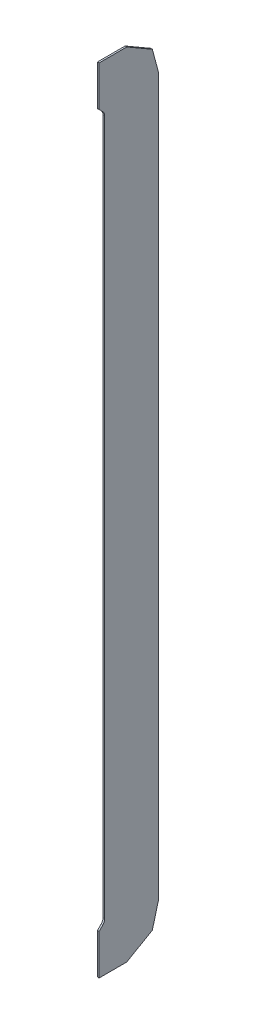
ISO-10303-21;
HEADER;
FILE_DESCRIPTION(('STEP AP214'),'2;1');
FILE_NAME('part.step','',(''),(''),'','','');
FILE_SCHEMA(('AUTOMOTIVE_DESIGN { 1 0 10303 214 1 1 1 1 }'));
ENDSEC;
DATA;
#1=APPLICATION_CONTEXT('core data for automotive mechanical design processes');
#2=APPLICATION_PROTOCOL_DEFINITION('international standard','automotive_design',2000,#1);
#3=PRODUCT_CONTEXT('',#1,'mechanical');
#4=PRODUCT('Part','Part','',(#3));
#5=PRODUCT_RELATED_PRODUCT_CATEGORY('part','',(#4));
#6=PRODUCT_DEFINITION_FORMATION('','',#4);
#7=PRODUCT_DEFINITION_CONTEXT('part definition',#1,'design');
#8=PRODUCT_DEFINITION('design','',#6,#7);
#9=PRODUCT_DEFINITION_SHAPE('','',#8);
#10=(LENGTH_UNIT() NAMED_UNIT(*) SI_UNIT(.MILLI.,.METRE.));
#11=(NAMED_UNIT(*) PLANE_ANGLE_UNIT() SI_UNIT($,.RADIAN.));
#12=(NAMED_UNIT(*) SI_UNIT($,.STERADIAN.) SOLID_ANGLE_UNIT());
#13=UNCERTAINTY_MEASURE_WITH_UNIT(LENGTH_MEASURE(1.E-05),#10,'distance_accuracy_value','');
#14=(GEOMETRIC_REPRESENTATION_CONTEXT(3) GLOBAL_UNCERTAINTY_ASSIGNED_CONTEXT((#13)) GLOBAL_UNIT_ASSIGNED_CONTEXT((#10,
#11,#12)) REPRESENTATION_CONTEXT('',''));
#15=CARTESIAN_POINT('',(0.,0.,0.));
#16=DIRECTION('',(0.,0.,1.));
#17=DIRECTION('',(1.,0.,0.));
#18=AXIS2_PLACEMENT_3D('',#15,#16,#17);
#19=CARTESIAN_POINT('',(19.0500000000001,8973.4125,673.00625));
#20=DIRECTION('',(0.,0.,-1.));
#21=DIRECTION('',(-1.,0.,0.));
#22=AXIS2_PLACEMENT_3D('',#19,#20,#21);
#23=PLANE('',#22);
#24=DIRECTION('',(1.,0.,0.));
#25=VECTOR('',#24,1.);
#26=CARTESIAN_POINT('',(-19.0500000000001,-8059.0125,673.00625));
#27=LINE('',#26,#25);
#28=CARTESIAN_POINT('',(-19.0500000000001,-8059.0125,673.00625));
#29=VERTEX_POINT('',#28);
#30=CARTESIAN_POINT('',(19.0500000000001,-8059.0125,673.00625));
#31=VERTEX_POINT('',#30);
#32=EDGE_CURVE('E155',#29,#31,#27,.T.);
#33=ORIENTED_EDGE('',*,*,#32,.F.);
#34=DIRECTION('',(0.,-1.,0.));
#35=VECTOR('',#34,1.);
#36=CARTESIAN_POINT('',(-19.0499999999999,8973.4125,673.00625));
#37=LINE('',#36,#35);
#38=CARTESIAN_POINT('',(-19.0499999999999,-8973.4125,673.00625));
#39=VERTEX_POINT('',#38);
#40=EDGE_CURVE('E189',#29,#39,#37,.T.);
#41=ORIENTED_EDGE('',*,*,#40,.T.);
#42=DIRECTION('',(1.,0.,0.));
#43=VECTOR('',#42,1.);
#44=CARTESIAN_POINT('',(19.0500000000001,-8973.4125,673.00625));
#45=LINE('',#44,#43);
#46=CARTESIAN_POINT('',(19.0500000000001,-8973.4125,673.00625));
#47=VERTEX_POINT('',#46);
#48=EDGE_CURVE('E177',#39,#47,#45,.T.);
#49=ORIENTED_EDGE('',*,*,#48,.T.);
#50=DIRECTION('',(0.,-1.,0.));
#51=VECTOR('',#50,1.);
#52=CARTESIAN_POINT('',(19.0500000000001,8973.4125,673.00625));
#53=LINE('',#52,#51);
#54=EDGE_CURVE('E171',#31,#47,#53,.T.);
#55=ORIENTED_EDGE('',*,*,#54,.F.);
#56=EDGE_LOOP('',(#33,#41,#49,#55));
#57=FACE_BOUND('',#56,.T.);
#58=ADVANCED_FACE('F53',(#57),#23,.F.);
#59=CARTESIAN_POINT('',(19.0500000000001,8973.4125,673.00625));
#60=DIRECTION('',(-1.,0.,0.));
#61=DIRECTION('',(0.,0.,1.));
#62=AXIS2_PLACEMENT_3D('',#59,#60,#61);
#63=PLANE('',#62);
#64=DIRECTION('',(0.,0.707106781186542,-0.707106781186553));
#65=VECTOR('',#64,1.);
#66=CARTESIAN_POINT('',(19.0500000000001,-8059.0125,673.00625));
#67=LINE('',#66,#65);
#68=CARTESIAN_POINT('',(19.0500000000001,-7977.59844891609,591.592198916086));
#69=VERTEX_POINT('',#68);
#70=EDGE_CURVE('E157',#31,#69,#67,.T.);
#71=ORIENTED_EDGE('',*,*,#70,.F.);
#72=ORIENTED_EDGE('',*,*,#54,.T.);
#73=DIRECTION('',(0.,0.,-1.));
#74=VECTOR('',#73,1.);
#75=CARTESIAN_POINT('',(19.0500000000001,-8973.4125,673.00625));
#76=LINE('',#75,#74);
#77=CARTESIAN_POINT('',(19.0500000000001,-8973.4125,47.426538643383));
#78=VERTEX_POINT('',#77);
#79=EDGE_CURVE('E258',#47,#78,#76,.T.);
#80=ORIENTED_EDGE('',*,*,#79,.T.);
#81=DIRECTION('',(0.,0.500000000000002,-0.866025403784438));
#82=VECTOR('',#81,1.);
#83=CARTESIAN_POINT('',(19.0500000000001,-6709.52308136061,-3873.74495715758));
#84=LINE('',#83,#82);
#85=CARTESIAN_POINT('',(19.0500000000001,-8638.88681789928,-531.988939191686));
#86=VERTEX_POINT('',#85);
#87=EDGE_CURVE('E215',#78,#86,#84,.T.);
#88=ORIENTED_EDGE('',*,*,#87,.T.);
#89=DIRECTION('',(0.,0.965925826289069,-0.258819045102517));
#90=VECTOR('',#89,1.);
#91=CARTESIAN_POINT('',(19.0500000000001,-711.6929213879,-2656.07414200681));
#92=LINE('',#91,#90);
#93=CARTESIAN_POINT('',(19.0500000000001,-8112.60304921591,-673.006250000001));
#94=VERTEX_POINT('',#93);
#95=EDGE_CURVE('E208',#86,#94,#92,.T.);
#96=ORIENTED_EDGE('',*,*,#95,.T.);
#97=DIRECTION('',(0.,-1.,0.));
#98=VECTOR('',#97,1.);
#99=CARTESIAN_POINT('',(19.0499999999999,8973.4125,-673.00625));
#100=LINE('',#99,#98);
#101=CARTESIAN_POINT('',(19.0499999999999,8112.60304921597,-673.00625));
#102=VERTEX_POINT('',#101);
#103=EDGE_CURVE('E182',#102,#94,#100,.T.);
#104=ORIENTED_EDGE('',*,*,#103,.F.);
#105=DIRECTION('',(0.,-0.965925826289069,-0.258819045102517));
#106=VECTOR('',#105,1.);
#107=CARTESIAN_POINT('',(19.0500000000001,711.6929213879,-2656.07414200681));
#108=LINE('',#107,#106);
#109=CARTESIAN_POINT('',(19.0500000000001,8638.88681789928,-531.988939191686));
#110=VERTEX_POINT('',#109);
#111=EDGE_CURVE('E76',#110,#102,#108,.T.);
#112=ORIENTED_EDGE('',*,*,#111,.F.);
#113=DIRECTION('',(0.,-0.500000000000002,-0.866025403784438));
#114=VECTOR('',#113,1.);
#115=CARTESIAN_POINT('',(19.0500000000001,6709.52308136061,-3873.74495715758));
#116=LINE('',#115,#114);
#117=CARTESIAN_POINT('',(19.0500000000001,8973.4125,47.426538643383));
#118=VERTEX_POINT('',#117);
#119=EDGE_CURVE('E237',#118,#110,#116,.T.);
#120=ORIENTED_EDGE('',*,*,#119,.F.);
#121=DIRECTION('',(0.,0.,-1.));
#122=VECTOR('',#121,1.);
#123=CARTESIAN_POINT('',(19.0500000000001,8973.4125,673.00625));
#124=LINE('',#123,#122);
#125=CARTESIAN_POINT('',(19.0500000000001,8973.4125,673.00625));
#126=VERTEX_POINT('',#125);
#127=EDGE_CURVE('E264',#126,#118,#124,.T.);
#128=ORIENTED_EDGE('',*,*,#127,.F.);
#129=CARTESIAN_POINT('',(19.0500000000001,8059.0125,673.00625));
#130=VERTEX_POINT('',#129);
#131=EDGE_CURVE('E185',#126,#130,#53,.T.);
#132=ORIENTED_EDGE('',*,*,#131,.T.);
#133=DIRECTION('',(0.,0.707106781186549,0.707106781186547));
#134=VECTOR('',#133,1.);
#135=CARTESIAN_POINT('',(19.0500000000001,8059.0125,673.00625));
#136=LINE('',#135,#134);
#137=CARTESIAN_POINT('',(19.0500000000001,7977.59844891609,591.592198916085));
#138=VERTEX_POINT('',#137);
#139=EDGE_CURVE('E320',#138,#130,#136,.T.);
#140=ORIENTED_EDGE('',*,*,#139,.F.);
#141=CARTESIAN_POINT('',(19.0500000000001,7867.99689783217,701.19375));
#142=DIRECTION('',(1.,0.,0.));
#143=DIRECTION('',(0.,0.,-1.));
#144=AXIS2_PLACEMENT_3D('',#141,#142,#143);
#145=CIRCLE('',#144,155.);
#146=CARTESIAN_POINT('',(19.0500000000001,7867.99689783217,546.19375));
#147=VERTEX_POINT('',#146);
#148=EDGE_CURVE('E318',#147,#138,#145,.T.);
#149=ORIENTED_EDGE('',*,*,#148,.F.);
#150=DIRECTION('',(0.,1.,0.));
#151=VECTOR('',#150,1.);
#152=CARTESIAN_POINT('',(19.0500000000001,-7867.99689783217,546.19375));
#153=LINE('',#152,#151);
#154=CARTESIAN_POINT('',(19.0500000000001,-7867.99689783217,546.19375));
#155=VERTEX_POINT('',#154);
#156=EDGE_CURVE('E337',#155,#147,#153,.T.);
#157=ORIENTED_EDGE('',*,*,#156,.F.);
#158=CARTESIAN_POINT('',(19.0500000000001,-7867.99689783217,701.19375));
#159=DIRECTION('',(1.,0.,0.));
#160=DIRECTION('',(0.,0.,1.));
#161=AXIS2_PLACEMENT_3D('',#158,#159,#160);
#162=CIRCLE('',#161,155.);
#163=EDGE_CURVE('E174',#69,#155,#162,.T.);
#164=ORIENTED_EDGE('',*,*,#163,.F.);
#165=EDGE_LOOP('',(#71,#72,#80,#88,#96,#104,#112,#120,#128,#132,#140,#149,#157,#164));
#166=FACE_BOUND('',#165,.T.);
#167=ADVANCED_FACE('F167',(#166),#63,.F.);
#168=CARTESIAN_POINT('',(-19.0499999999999,8973.4125,673.00625));
#169=DIRECTION('',(1.,0.,0.));
#170=DIRECTION('',(0.,0.,-1.));
#171=AXIS2_PLACEMENT_3D('',#168,#169,#170);
#172=PLANE('',#171);
#173=CARTESIAN_POINT('',(-19.0500000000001,7867.99689783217,701.19375));
#174=DIRECTION('',(1.,0.,0.));
#175=DIRECTION('',(0.,0.,-1.));
#176=AXIS2_PLACEMENT_3D('',#173,#174,#175);
#177=CIRCLE('',#176,155.);
#178=CARTESIAN_POINT('',(-19.0500000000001,7867.99689783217,546.19375));
#179=VERTEX_POINT('',#178);
#180=CARTESIAN_POINT('',(-19.0500000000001,7977.59844891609,591.592198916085));
#181=VERTEX_POINT('',#180);
#182=EDGE_CURVE('E323',#179,#181,#177,.T.);
#183=ORIENTED_EDGE('',*,*,#182,.T.);
#184=DIRECTION('',(0.,0.707106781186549,0.707106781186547));
#185=VECTOR('',#184,1.);
#186=CARTESIAN_POINT('',(-19.0500000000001,8059.0125,673.00625));
#187=LINE('',#186,#185);
#188=CARTESIAN_POINT('',(-19.0500000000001,8059.0125,673.00625));
#189=VERTEX_POINT('',#188);
#190=EDGE_CURVE('E170',#181,#189,#187,.T.);
#191=ORIENTED_EDGE('',*,*,#190,.T.);
#192=CARTESIAN_POINT('',(-19.0499999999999,8973.4125,673.00625));
#193=VERTEX_POINT('',#192);
#194=EDGE_CURVE('E191',#193,#189,#37,.T.);
#195=ORIENTED_EDGE('',*,*,#194,.F.);
#196=DIRECTION('',(0.,0.,1.));
#197=VECTOR('',#196,1.);
#198=CARTESIAN_POINT('',(-19.0499999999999,8973.4125,673.00625));
#199=LINE('',#198,#197);
#200=CARTESIAN_POINT('',(-19.0500000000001,8973.4125,47.426538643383));
#201=VERTEX_POINT('',#200);
#202=EDGE_CURVE('E257',#201,#193,#199,.T.);
#203=ORIENTED_EDGE('',*,*,#202,.F.);
#204=DIRECTION('',(0.,-0.500000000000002,-0.866025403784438));
#205=VECTOR('',#204,1.);
#206=CARTESIAN_POINT('',(-19.0500000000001,6709.52308136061,-3873.74495715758));
#207=LINE('',#206,#205);
#208=CARTESIAN_POINT('',(-19.0500000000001,8638.88681789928,-531.988939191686));
#209=VERTEX_POINT('',#208);
#210=EDGE_CURVE('E246',#201,#209,#207,.T.);
#211=ORIENTED_EDGE('',*,*,#210,.T.);
#212=DIRECTION('',(0.,-0.965925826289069,-0.258819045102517));
#213=VECTOR('',#212,1.);
#214=CARTESIAN_POINT('',(-19.0500000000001,711.6929213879,-2656.07414200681));
#215=LINE('',#214,#213);
#216=CARTESIAN_POINT('',(-19.0500000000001,8112.60304921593,-673.006249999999));
#217=VERTEX_POINT('',#216);
#218=EDGE_CURVE('E249',#209,#217,#215,.T.);
#219=ORIENTED_EDGE('',*,*,#218,.T.);
#220=DIRECTION('',(0.,-1.,0.));
#221=VECTOR('',#220,1.);
#222=CARTESIAN_POINT('',(-19.0500000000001,8973.4125,-673.00625));
#223=LINE('',#222,#221);
#224=CARTESIAN_POINT('',(-19.0500000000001,-8112.60304921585,-673.00625));
#225=VERTEX_POINT('',#224);
#226=EDGE_CURVE('E188',#217,#225,#223,.T.);
#227=ORIENTED_EDGE('',*,*,#226,.T.);
#228=DIRECTION('',(0.,0.965925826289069,-0.258819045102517));
#229=VECTOR('',#228,1.);
#230=CARTESIAN_POINT('',(-19.0500000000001,-711.6929213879,-2656.07414200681));
#231=LINE('',#230,#229);
#232=CARTESIAN_POINT('',(-19.0500000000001,-8638.88681789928,-531.988939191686));
#233=VERTEX_POINT('',#232);
#234=EDGE_CURVE('E220',#233,#225,#231,.T.);
#235=ORIENTED_EDGE('',*,*,#234,.F.);
#236=DIRECTION('',(0.,0.500000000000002,-0.866025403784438));
#237=VECTOR('',#236,1.);
#238=CARTESIAN_POINT('',(-19.0500000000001,-6709.52308136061,-3873.74495715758));
#239=LINE('',#238,#237);
#240=CARTESIAN_POINT('',(-19.0500000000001,-8973.4125,47.426538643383));
#241=VERTEX_POINT('',#240);
#242=EDGE_CURVE('E226',#241,#233,#239,.T.);
#243=ORIENTED_EDGE('',*,*,#242,.F.);
#244=DIRECTION('',(0.,0.,1.));
#245=VECTOR('',#244,1.);
#246=CARTESIAN_POINT('',(-19.0499999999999,-8973.4125,673.00625));
#247=LINE('',#246,#245);
#248=EDGE_CURVE('E236',#241,#39,#247,.T.);
#249=ORIENTED_EDGE('',*,*,#248,.T.);
#250=ORIENTED_EDGE('',*,*,#40,.F.);
#251=DIRECTION('',(0.,0.707106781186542,-0.707106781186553));
#252=VECTOR('',#251,1.);
#253=CARTESIAN_POINT('',(-19.0500000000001,-8059.0125,673.00625));
#254=LINE('',#253,#252);
#255=CARTESIAN_POINT('',(-19.0500000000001,-7977.59844891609,591.592198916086));
#256=VERTEX_POINT('',#255);
#257=EDGE_CURVE('E163',#29,#256,#254,.T.);
#258=ORIENTED_EDGE('',*,*,#257,.T.);
#259=CARTESIAN_POINT('',(-19.0500000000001,-7867.99689783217,701.19375));
#260=DIRECTION('',(1.,0.,0.));
#261=DIRECTION('',(0.,0.,1.));
#262=AXIS2_PLACEMENT_3D('',#259,#260,#261);
#263=CIRCLE('',#262,155.);
#264=CARTESIAN_POINT('',(-19.0499999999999,-7867.99689783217,546.19375));
#265=VERTEX_POINT('',#264);
#266=EDGE_CURVE('E312',#256,#265,#263,.T.);
#267=ORIENTED_EDGE('',*,*,#266,.T.);
#268=DIRECTION('',(0.,1.,0.));
#269=VECTOR('',#268,1.);
#270=CARTESIAN_POINT('',(-19.0500000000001,-7867.99689783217,546.19375));
#271=LINE('',#270,#269);
#272=EDGE_CURVE('E70',#265,#179,#271,.T.);
#273=ORIENTED_EDGE('',*,*,#272,.T.);
#274=EDGE_LOOP('',(#183,#191,#195,#203,#211,#219,#227,#235,#243,#249,#250,#258,#267,#273));
#275=FACE_BOUND('',#274,.T.);
#276=ADVANCED_FACE('F57',(#275),#172,.F.);
#277=CARTESIAN_POINT('',(19.0499999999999,8973.4125,-673.00625));
#278=DIRECTION('',(0.,0.,1.));
#279=DIRECTION('',(1.,0.,0.));
#280=AXIS2_PLACEMENT_3D('',#277,#278,#279);
#281=PLANE('',#280);
#282=DIRECTION('',(1.,0.,0.));
#283=VECTOR('',#282,1.);
#284=CARTESIAN_POINT('',(19.0499999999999,-8112.60304921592,-673.00625));
#285=LINE('',#284,#283);
#286=EDGE_CURVE('E12',#225,#94,#285,.T.);
#287=ORIENTED_EDGE('',*,*,#286,.F.);
#288=ORIENTED_EDGE('',*,*,#226,.F.);
#289=DIRECTION('',(1.,0.,0.));
#290=VECTOR('',#289,1.);
#291=CARTESIAN_POINT('',(19.0499999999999,8112.60304921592,-673.00625));
#292=LINE('',#291,#290);
#293=EDGE_CURVE('E64',#217,#102,#292,.T.);
#294=ORIENTED_EDGE('',*,*,#293,.T.);
#295=ORIENTED_EDGE('',*,*,#103,.T.);
#296=EDGE_LOOP('',(#287,#288,#294,#295));
#297=FACE_BOUND('',#296,.T.);
#298=ADVANCED_FACE('F205',(#297),#281,.F.);
#299=ORIENTED_EDGE('',*,*,#194,.T.);
#300=DIRECTION('',(1.,0.,0.));
#301=VECTOR('',#300,1.);
#302=CARTESIAN_POINT('',(-19.0500000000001,8059.0125,673.00625));
#303=LINE('',#302,#301);
#304=EDGE_CURVE('E243',#189,#130,#303,.T.);
#305=ORIENTED_EDGE('',*,*,#304,.T.);
#306=ORIENTED_EDGE('',*,*,#131,.F.);
#307=DIRECTION('',(1.,0.,0.));
#308=VECTOR('',#307,1.);
#309=CARTESIAN_POINT('',(19.0500000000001,8973.4125,673.00625));
#310=LINE('',#309,#308);
#311=EDGE_CURVE('E256',#193,#126,#310,.T.);
#312=ORIENTED_EDGE('',*,*,#311,.F.);
#313=EDGE_LOOP('',(#299,#305,#306,#312));
#314=FACE_BOUND('',#313,.T.);
#315=ADVANCED_FACE('F293',(#314),#23,.F.);
#316=CARTESIAN_POINT('',(0.,8973.4125,0.));
#317=DIRECTION('',(0.,1.,0.));
#318=DIRECTION('',(0.,0.,1.));
#319=AXIS2_PLACEMENT_3D('',#316,#317,#318);
#320=PLANE('',#319);
#321=ORIENTED_EDGE('',*,*,#127,.T.);
#322=DIRECTION('',(1.,0.,0.));
#323=VECTOR('',#322,1.);
#324=CARTESIAN_POINT('',(-19.0500000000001,8973.4125,47.426538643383));
#325=LINE('',#324,#323);
#326=EDGE_CURVE('E225',#201,#118,#325,.T.);
#327=ORIENTED_EDGE('',*,*,#326,.F.);
#328=ORIENTED_EDGE('',*,*,#202,.T.);
#329=ORIENTED_EDGE('',*,*,#311,.T.);
#330=EDGE_LOOP('',(#321,#327,#328,#329));
#331=FACE_BOUND('',#330,.T.);
#332=ADVANCED_FACE('F286',(#331),#320,.T.);
#333=CARTESIAN_POINT('',(0.,-8973.4125,0.));
#334=DIRECTION('',(0.,1.,0.));
#335=DIRECTION('',(0.,0.,1.));
#336=AXIS2_PLACEMENT_3D('',#333,#334,#335);
#337=PLANE('',#336);
#338=ORIENTED_EDGE('',*,*,#48,.F.);
#339=ORIENTED_EDGE('',*,*,#248,.F.);
#340=DIRECTION('',(1.,0.,0.));
#341=VECTOR('',#340,1.);
#342=CARTESIAN_POINT('',(-19.0500000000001,-8973.4125,47.426538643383));
#343=LINE('',#342,#341);
#344=EDGE_CURVE('E235',#241,#78,#343,.T.);
#345=ORIENTED_EDGE('',*,*,#344,.T.);
#346=ORIENTED_EDGE('',*,*,#79,.F.);
#347=EDGE_LOOP('',(#338,#339,#345,#346));
#348=FACE_BOUND('',#347,.T.);
#349=ADVANCED_FACE('F365',(#348),#337,.F.);
#350=CARTESIAN_POINT('',(-19.0500000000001,711.6929213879,-2656.07414200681));
#351=DIRECTION('',(0.,-0.258819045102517,0.965925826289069));
#352=DIRECTION('',(0.,-0.965925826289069,-0.258819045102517));
#353=AXIS2_PLACEMENT_3D('',#350,#351,#352);
#354=PLANE('',#353);
#355=ORIENTED_EDGE('',*,*,#218,.F.);
#356=DIRECTION('',(1.,0.,0.));
#357=VECTOR('',#356,1.);
#358=CARTESIAN_POINT('',(-19.0500000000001,8638.88681789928,-531.988939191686));
#359=LINE('',#358,#357);
#360=EDGE_CURVE('E216',#209,#110,#359,.T.);
#361=ORIENTED_EDGE('',*,*,#360,.T.);
#362=ORIENTED_EDGE('',*,*,#111,.T.);
#363=ORIENTED_EDGE('',*,*,#293,.F.);
#364=EDGE_LOOP('',(#355,#361,#362,#363));
#365=FACE_BOUND('',#364,.T.);
#366=ADVANCED_FACE('F279',(#365),#354,.F.);
#367=CARTESIAN_POINT('',(-19.0500000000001,6709.52308136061,-3873.74495715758));
#368=DIRECTION('',(0.,-0.866025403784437,0.500000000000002));
#369=DIRECTION('',(0.,-0.500000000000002,-0.866025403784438));
#370=AXIS2_PLACEMENT_3D('',#367,#368,#369);
#371=PLANE('',#370);
#372=ORIENTED_EDGE('',*,*,#360,.F.);
#373=ORIENTED_EDGE('',*,*,#210,.F.);
#374=ORIENTED_EDGE('',*,*,#326,.T.);
#375=ORIENTED_EDGE('',*,*,#119,.T.);
#376=EDGE_LOOP('',(#372,#373,#374,#375));
#377=FACE_BOUND('',#376,.T.);
#378=ADVANCED_FACE('F278',(#377),#371,.F.);
#379=CARTESIAN_POINT('',(-19.0500000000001,-711.6929213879,-2656.07414200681));
#380=DIRECTION('',(0.,-0.258819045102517,-0.965925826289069));
#381=DIRECTION('',(0.,0.965925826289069,-0.258819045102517));
#382=AXIS2_PLACEMENT_3D('',#379,#380,#381);
#383=PLANE('',#382);
#384=ORIENTED_EDGE('',*,*,#286,.T.);
#385=ORIENTED_EDGE('',*,*,#95,.F.);
#386=DIRECTION('',(1.,0.,0.));
#387=VECTOR('',#386,1.);
#388=CARTESIAN_POINT('',(-19.0500000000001,-8638.88681789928,-531.988939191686));
#389=LINE('',#388,#387);
#390=EDGE_CURVE('E233',#233,#86,#389,.T.);
#391=ORIENTED_EDGE('',*,*,#390,.F.);
#392=ORIENTED_EDGE('',*,*,#234,.T.);
#393=EDGE_LOOP('',(#384,#385,#391,#392));
#394=FACE_BOUND('',#393,.T.);
#395=ADVANCED_FACE('F372',(#394),#383,.T.);
#396=CARTESIAN_POINT('',(-19.0500000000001,-6709.52308136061,-3873.74495715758));
#397=DIRECTION('',(0.,-0.866025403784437,-0.500000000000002));
#398=DIRECTION('',(0.,0.500000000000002,-0.866025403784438));
#399=AXIS2_PLACEMENT_3D('',#396,#397,#398);
#400=PLANE('',#399);
#401=ORIENTED_EDGE('',*,*,#344,.F.);
#402=ORIENTED_EDGE('',*,*,#242,.T.);
#403=ORIENTED_EDGE('',*,*,#390,.T.);
#404=ORIENTED_EDGE('',*,*,#87,.F.);
#405=EDGE_LOOP('',(#401,#402,#403,#404));
#406=FACE_BOUND('',#405,.T.);
#407=ADVANCED_FACE('F378',(#406),#400,.T.);
#408=CARTESIAN_POINT('',(-19.0500000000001,8059.0125,673.00625));
#409=DIRECTION('',(0.,0.707106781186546,-0.707106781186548));
#410=DIRECTION('',(0.,0.707106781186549,0.707106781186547));
#411=AXIS2_PLACEMENT_3D('',#408,#409,#410);
#412=PLANE('',#411);
#413=ORIENTED_EDGE('',*,*,#304,.F.);
#414=ORIENTED_EDGE('',*,*,#190,.F.);
#415=DIRECTION('',(1.,0.,0.));
#416=VECTOR('',#415,1.);
#417=CARTESIAN_POINT('',(-19.0500000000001,7977.59844891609,591.592198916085));
#418=LINE('',#417,#416);
#419=EDGE_CURVE('E298',#181,#138,#418,.T.);
#420=ORIENTED_EDGE('',*,*,#419,.T.);
#421=ORIENTED_EDGE('',*,*,#139,.T.);
#422=EDGE_LOOP('',(#413,#414,#420,#421));
#423=FACE_BOUND('',#422,.T.);
#424=ADVANCED_FACE('F328',(#423),#412,.F.);
#425=CARTESIAN_POINT('',(-19.0500000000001,7867.99689783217,701.19375));
#426=DIRECTION('',(1.,0.,0.));
#427=DIRECTION('',(0.,0.,-1.));
#428=AXIS2_PLACEMENT_3D('',#425,#426,#427);
#429=CYLINDRICAL_SURFACE('',#428,155.);
#430=ORIENTED_EDGE('',*,*,#419,.F.);
#431=ORIENTED_EDGE('',*,*,#182,.F.);
#432=DIRECTION('',(1.,0.,0.));
#433=VECTOR('',#432,1.);
#434=CARTESIAN_POINT('',(-19.0500000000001,7867.99689783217,546.19375));
#435=LINE('',#434,#433);
#436=EDGE_CURVE('E299',#179,#147,#435,.T.);
#437=ORIENTED_EDGE('',*,*,#436,.T.);
#438=ORIENTED_EDGE('',*,*,#148,.T.);
#439=EDGE_LOOP('',(#430,#431,#437,#438));
#440=FACE_BOUND('',#439,.T.);
#441=ADVANCED_FACE('F332',(#440),#429,.F.);
#442=CARTESIAN_POINT('',(-19.0500000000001,-7867.99689783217,546.19375));
#443=DIRECTION('',(0.,0.,-1.));
#444=DIRECTION('',(0.,1.,0.));
#445=AXIS2_PLACEMENT_3D('',#442,#443,#444);
#446=PLANE('',#445);
#447=ORIENTED_EDGE('',*,*,#436,.F.);
#448=ORIENTED_EDGE('',*,*,#272,.F.);
#449=DIRECTION('',(1.,0.,0.));
#450=VECTOR('',#449,1.);
#451=CARTESIAN_POINT('',(-19.0500000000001,-7867.99689783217,546.19375));
#452=LINE('',#451,#450);
#453=EDGE_CURVE('E306',#265,#155,#452,.T.);
#454=ORIENTED_EDGE('',*,*,#453,.T.);
#455=ORIENTED_EDGE('',*,*,#156,.T.);
#456=EDGE_LOOP('',(#447,#448,#454,#455));
#457=FACE_BOUND('',#456,.T.);
#458=ADVANCED_FACE('F342',(#457),#446,.F.);
#459=CARTESIAN_POINT('',(-19.0500000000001,-7867.99689783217,701.19375));
#460=DIRECTION('',(1.,0.,0.));
#461=DIRECTION('',(0.,0.,-1.));
#462=AXIS2_PLACEMENT_3D('',#459,#460,#461);
#463=CYLINDRICAL_SURFACE('',#462,155.);
#464=ORIENTED_EDGE('',*,*,#453,.F.);
#465=ORIENTED_EDGE('',*,*,#266,.F.);
#466=DIRECTION('',(1.,0.,0.));
#467=VECTOR('',#466,1.);
#468=CARTESIAN_POINT('',(-19.0500000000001,-7977.59844891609,591.592198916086));
#469=LINE('',#468,#467);
#470=EDGE_CURVE('E168',#256,#69,#469,.T.);
#471=ORIENTED_EDGE('',*,*,#470,.T.);
#472=ORIENTED_EDGE('',*,*,#163,.T.);
#473=EDGE_LOOP('',(#464,#465,#471,#472));
#474=FACE_BOUND('',#473,.T.);
#475=ADVANCED_FACE('F311',(#474),#463,.F.);
#476=CARTESIAN_POINT('',(-19.0500000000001,-8059.0125,673.00625));
#477=DIRECTION('',(0.,-0.707106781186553,-0.707106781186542));
#478=DIRECTION('',(0.,0.707106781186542,-0.707106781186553));
#479=AXIS2_PLACEMENT_3D('',#476,#477,#478);
#480=PLANE('',#479);
#481=ORIENTED_EDGE('',*,*,#470,.F.);
#482=ORIENTED_EDGE('',*,*,#257,.F.);
#483=ORIENTED_EDGE('',*,*,#32,.T.);
#484=ORIENTED_EDGE('',*,*,#70,.T.);
#485=EDGE_LOOP('',(#481,#482,#483,#484));
#486=FACE_BOUND('',#485,.T.);
#487=ADVANCED_FACE('F160',(#486),#480,.F.);
#488=CLOSED_SHELL('',(#58,#167,#276,#298,#315,#332,#349,#366,#378,#395,#407,#424,#441,#458,#475,#487));
#489=MANIFOLD_SOLID_BREP('B2',#488);
#490=ADVANCED_BREP_SHAPE_REPRESENTATION('',(#18,#489),#14);
#491=SHAPE_DEFINITION_REPRESENTATION(#9,#490);
ENDSEC;
END-ISO-10303-21;
